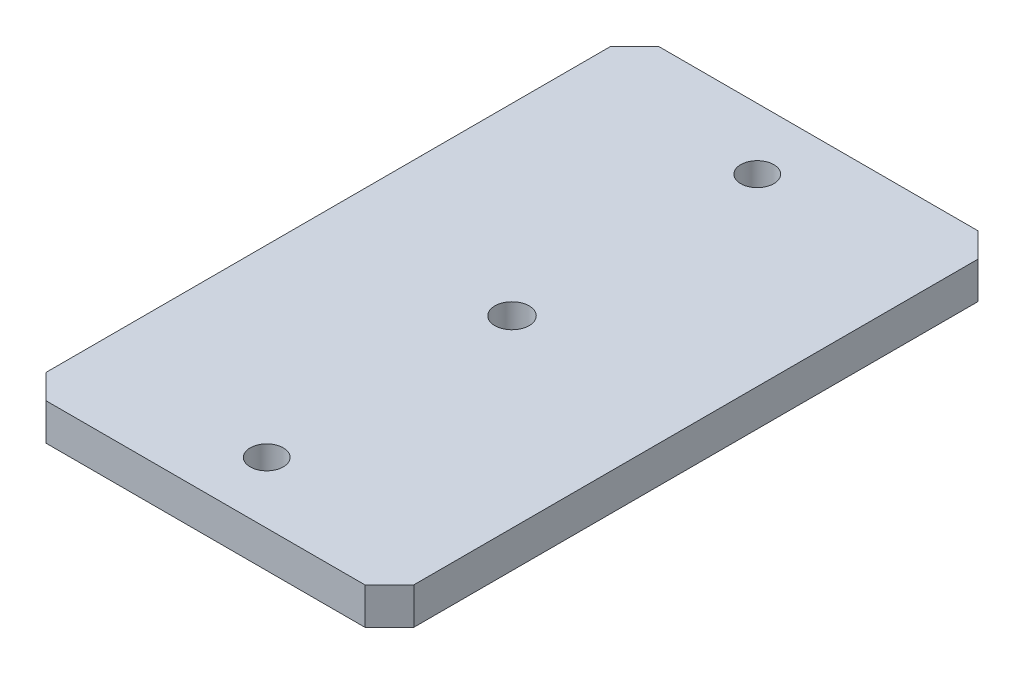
from build123d import *

# Parameters (mm, degrees)
EXTRUSION1_DEPTH   = 15
D_GAGEMENT_M121_D  = 13.5
TROU_TARAUD_M161_D = 14
CHANFREIN1_SIZE    = 10


with BuildPart() as part:
    # Esquisse1 → Extrusion1 (new body)
    with BuildSketch(Plane(origin=(0, 0, 0), x_dir=(1, 0, 0), z_dir=(0, 1, 0))):
        Polygon((0, 0), (75, -125), (75, 125), align=None)
        Polygon((0, 0), (-75, -125), (75, -125), align=None)
        Polygon((-75, 125), (-75, -125), (0, 0), align=None)
        Polygon((75, 125), (-75, 125), (0, 0), align=None)
    extrude(amount=EXTRUSION1_DEPTH)

    # D_gagement M121 (through all)
    with Locations(Plane(origin=(0, 15, 100), x_dir=(0, 0, 1), z_dir=(0, 1, 0))):
        with Locations((0, 0), (-200, 0)):
            Hole(D_GAGEMENT_M121_D / 2)

    # Trou taraud_ M161 (through all)
    with Locations(Plane.ZX.offset(15)):
        with Locations((0, 0)):
            Hole(TROU_TARAUD_M161_D / 2)

    # Chanfrein1
    chanfrein1_edges = [part.edges().sort_by_distance(p)[0] for p in [
        (75, 7.5, -125),
        (75, 7.5, 125),
        (-75, 7.5, 125),
        (-75, 7.5, -125),
    ]]
    chamfer(chanfrein1_edges, length=CHANFREIN1_SIZE)


solid = part.part
